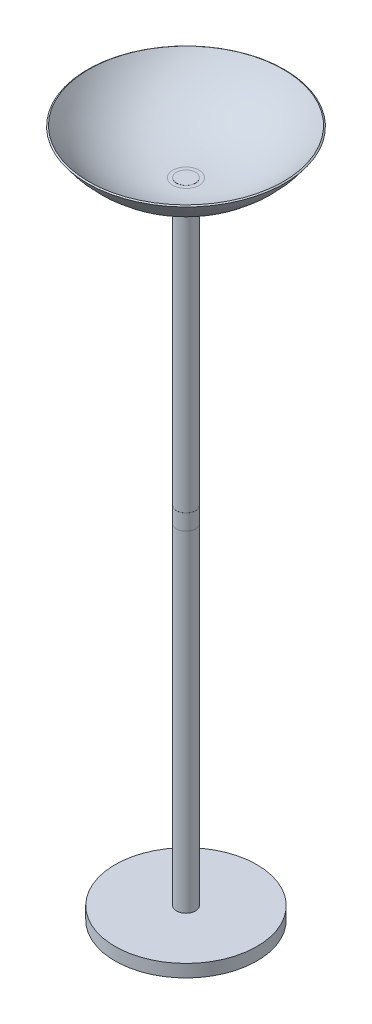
ISO-10303-21;
HEADER;
FILE_DESCRIPTION(('STEP AP214'),'2;1');
FILE_NAME('part.step','',(''),(''),'','','');
FILE_SCHEMA(('AUTOMOTIVE_DESIGN { 1 0 10303 214 1 1 1 1 }'));
ENDSEC;
DATA;
#1=APPLICATION_CONTEXT('core data for automotive mechanical design processes');
#2=APPLICATION_PROTOCOL_DEFINITION('international standard','automotive_design',2000,#1);
#3=PRODUCT_CONTEXT('',#1,'mechanical');
#4=PRODUCT('Part','Part','',(#3));
#5=PRODUCT_RELATED_PRODUCT_CATEGORY('part','',(#4));
#6=PRODUCT_DEFINITION_FORMATION('','',#4);
#7=PRODUCT_DEFINITION_CONTEXT('part definition',#1,'design');
#8=PRODUCT_DEFINITION('design','',#6,#7);
#9=PRODUCT_DEFINITION_SHAPE('','',#8);
#10=(LENGTH_UNIT() NAMED_UNIT(*) SI_UNIT(.MILLI.,.METRE.));
#11=(NAMED_UNIT(*) PLANE_ANGLE_UNIT() SI_UNIT($,.RADIAN.));
#12=(NAMED_UNIT(*) SI_UNIT($,.STERADIAN.) SOLID_ANGLE_UNIT());
#13=UNCERTAINTY_MEASURE_WITH_UNIT(LENGTH_MEASURE(1.E-05),#10,'distance_accuracy_value','');
#14=(GEOMETRIC_REPRESENTATION_CONTEXT(3) GLOBAL_UNCERTAINTY_ASSIGNED_CONTEXT((#13)) GLOBAL_UNIT_ASSIGNED_CONTEXT((#10,
#11,#12)) REPRESENTATION_CONTEXT('',''));
#15=CARTESIAN_POINT('',(0.,0.,0.));
#16=DIRECTION('',(0.,0.,1.));
#17=DIRECTION('',(1.,0.,0.));
#18=AXIS2_PLACEMENT_3D('',#15,#16,#17);
#19=CARTESIAN_POINT('',(0.,972.759098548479,0.));
#20=DIRECTION('',(0.,-1.,0.));
#21=DIRECTION('',(0.,0.,-1.));
#22=AXIS2_PLACEMENT_3D('',#19,#20,#21);
#23=CYLINDRICAL_SURFACE('',#22,24.);
#24=CARTESIAN_POINT('',(0.,252.759098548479,0.));
#25=DIRECTION('',(0.,-1.,0.));
#26=DIRECTION('',(0.,0.,-1.));
#27=AXIS2_PLACEMENT_3D('',#24,#25,#26);
#28=CIRCLE('',#27,24.);
#29=CARTESIAN_POINT('',(0.,252.759098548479,-24.));
#30=VERTEX_POINT('',#29);
#31=EDGE_CURVE('E44',#30,#30,#28,.T.);
#32=CARTESIAN_POINT('',(0.,968.592614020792,0.));
#33=DIRECTION('',(0.,1.,0.));
#34=DIRECTION('',(0.,0.,1.));
#35=AXIS2_PLACEMENT_3D('',#32,#33,#34);
#36=CIRCLE('',#35,24.);
#37=CARTESIAN_POINT('',(0.,968.592614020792,-24.));
#38=VERTEX_POINT('',#37);
#39=EDGE_CURVE('E10',#38,#38,#36,.T.);
#40=CARTESIAN_POINT('',(0.,252.759098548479,-24.));
#41=CARTESIAN_POINT('',(0.,260.215697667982,-24.));
#42=CARTESIAN_POINT('',(0.,267.672296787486,-24.));
#43=CARTESIAN_POINT('',(0.,282.585495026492,-24.));
#44=CARTESIAN_POINT('',(0.,290.042094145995,-24.));
#45=CARTESIAN_POINT('',(0.,304.955292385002,-24.));
#46=CARTESIAN_POINT('',(0.,312.411891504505,-24.));
#47=CARTESIAN_POINT('',(0.,327.325089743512,-24.));
#48=CARTESIAN_POINT('',(0.,334.781688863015,-24.));
#49=CARTESIAN_POINT('',(0.,349.694887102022,-24.));
#50=CARTESIAN_POINT('',(0.,357.151486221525,-24.));
#51=CARTESIAN_POINT('',(0.,372.064684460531,-24.));
#52=CARTESIAN_POINT('',(0.,379.521283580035,-24.));
#53=CARTESIAN_POINT('',(0.,394.434481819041,-24.));
#54=CARTESIAN_POINT('',(0.,401.891080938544,-24.));
#55=CARTESIAN_POINT('',(0.,416.804279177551,-24.));
#56=CARTESIAN_POINT('',(0.,424.260878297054,-24.));
#57=CARTESIAN_POINT('',(0.,439.174076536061,-24.));
#58=CARTESIAN_POINT('',(0.,446.630675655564,-24.));
#59=CARTESIAN_POINT('',(0.,461.543873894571,-24.));
#60=CARTESIAN_POINT('',(0.,469.000473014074,-24.));
#61=CARTESIAN_POINT('',(0.,483.91367125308,-24.));
#62=CARTESIAN_POINT('',(0.,491.370270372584,-24.));
#63=CARTESIAN_POINT('',(0.,506.28346861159,-24.));
#64=CARTESIAN_POINT('',(0.,513.740067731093,-24.));
#65=CARTESIAN_POINT('',(0.,528.6532659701,-24.));
#66=CARTESIAN_POINT('',(0.,536.109865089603,-24.));
#67=CARTESIAN_POINT('',(0.,551.02306332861,-24.));
#68=CARTESIAN_POINT('',(0.,558.479662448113,-24.));
#69=CARTESIAN_POINT('',(0.,573.392860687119,-24.));
#70=CARTESIAN_POINT('',(0.,580.849459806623,-24.));
#71=CARTESIAN_POINT('',(0.,595.762658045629,-24.));
#72=CARTESIAN_POINT('',(0.,603.219257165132,-24.));
#73=CARTESIAN_POINT('',(0.,618.132455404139,-24.));
#74=CARTESIAN_POINT('',(0.,625.589054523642,-24.));
#75=CARTESIAN_POINT('',(0.,640.502252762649,-24.));
#76=CARTESIAN_POINT('',(0.,647.958851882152,-24.));
#77=CARTESIAN_POINT('',(0.,662.872050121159,-24.));
#78=CARTESIAN_POINT('',(0.,670.328649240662,-24.));
#79=CARTESIAN_POINT('',(0.,685.241847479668,-24.));
#80=CARTESIAN_POINT('',(0.,692.698446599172,-24.));
#81=CARTESIAN_POINT('',(0.,707.611644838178,-24.));
#82=CARTESIAN_POINT('',(0.,715.068243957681,-24.));
#83=CARTESIAN_POINT('',(0.,729.981442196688,-24.));
#84=CARTESIAN_POINT('',(0.,737.438041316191,-24.));
#85=CARTESIAN_POINT('',(0.,752.351239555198,-24.));
#86=CARTESIAN_POINT('',(0.,759.807838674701,-24.));
#87=CARTESIAN_POINT('',(0.,774.721036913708,-24.));
#88=CARTESIAN_POINT('',(0.,782.177636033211,-24.));
#89=CARTESIAN_POINT('',(0.,797.090834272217,-24.));
#90=CARTESIAN_POINT('',(0.,804.547433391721,-24.));
#91=CARTESIAN_POINT('',(0.,819.460631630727,-24.));
#92=CARTESIAN_POINT('',(0.,826.91723075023,-24.));
#93=CARTESIAN_POINT('',(0.,841.830428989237,-24.));
#94=CARTESIAN_POINT('',(0.,849.28702810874,-24.));
#95=CARTESIAN_POINT('',(0.,864.200226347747,-24.));
#96=CARTESIAN_POINT('',(0.,871.65682546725,-24.));
#97=CARTESIAN_POINT('',(0.,886.570023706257,-24.));
#98=CARTESIAN_POINT('',(0.,894.02662282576,-24.));
#99=CARTESIAN_POINT('',(0.,908.939821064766,-24.));
#100=CARTESIAN_POINT('',(0.,916.39642018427,-24.));
#101=CARTESIAN_POINT('',(0.,931.309618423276,-24.));
#102=CARTESIAN_POINT('',(0.,938.766217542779,-24.));
#103=CARTESIAN_POINT('',(0.,953.679415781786,-24.));
#104=CARTESIAN_POINT('',(0.,961.136014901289,-24.));
#105=CARTESIAN_POINT('',(0.,968.592614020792,-24.));
#106=B_SPLINE_CURVE_WITH_KNOTS('',3,(#40,#41,#42,#43,#44,#45,#46,#47,#48,#49,#50,#51,#52,#53,
#54,#55,#56,#57,#58,#59,#60,#61,#62,#63,#64,#65,#66,#67,#68,#69,#70,#71,#72,#73,#74,#75,#76,#77,
#78,#79,#80,#81,#82,#83,#84,#85,#86,#87,#88,#89,#90,#91,#92,#93,#94,#95,#96,#97,#98,#99,#100,
#101,#102,#103,#104,#105),.UNSPECIFIED.,.F.,.F.,(4,2,2,2,2,2,2,2,2,2,2,2,2,2,2,2,2,2,2,2,2,2,2,
2,2,2,2,2,2,2,2,2,4),(0.,22.3697973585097,44.7395947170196,67.1093920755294,89.4791894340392,
111.848986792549,134.218784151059,156.588581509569,178.958378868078,201.328176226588,
223.697973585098,246.067770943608,268.437568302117,290.807365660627,313.177163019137,
335.546960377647,357.916757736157,380.286555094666,402.656352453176,425.026149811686,
447.395947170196,469.765744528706,492.135541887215,514.505339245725,536.875136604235,
559.244933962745,581.614731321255,603.984528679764,626.354326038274,648.724123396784,
671.093920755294,693.463718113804,715.833515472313),.UNSPECIFIED.);
#107=EDGE_CURVE('BSEAM32',#30,#38,#106,.T.);
#108=ORIENTED_EDGE('',*,*,#31,.F.);
#109=ORIENTED_EDGE('',*,*,#39,.F.);
#110=ORIENTED_EDGE('',*,*,#107,.T.);
#111=ORIENTED_EDGE('',*,*,#107,.F.);
#112=EDGE_LOOP('',(#108,#110,#109,#111));
#113=FACE_BOUND('',#112,.T.);
#114=ADVANCED_FACE('F32',(#113),#23,.T.);
#115=CARTESIAN_POINT('',(0.,212.759098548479,0.));
#116=DIRECTION('',(0.,-1.,0.));
#117=DIRECTION('',(0.,0.,-1.));
#118=AXIS2_PLACEMENT_3D('',#115,#116,#117);
#119=PLANE('',#118);
#120=CARTESIAN_POINT('',(0.,212.759098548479,0.));
#121=DIRECTION('',(0.,-1.,0.));
#122=DIRECTION('',(0.,0.,-1.));
#123=AXIS2_PLACEMENT_3D('',#120,#121,#122);
#124=CIRCLE('',#123,24.2);
#125=CARTESIAN_POINT('',(0.,212.759098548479,-24.2));
#126=VERTEX_POINT('',#125);
#127=EDGE_CURVE('E49',#126,#126,#124,.T.);
#128=ORIENTED_EDGE('',*,*,#127,.T.);
#129=EDGE_LOOP('',(#128));
#130=FACE_BOUND('',#129,.T.);
#131=CARTESIAN_POINT('',(0.,212.759098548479,0.));
#132=DIRECTION('',(0.,-1.,0.));
#133=DIRECTION('',(0.,0.,-1.));
#134=AXIS2_PLACEMENT_3D('',#131,#132,#133);
#135=CIRCLE('',#134,24.);
#136=CARTESIAN_POINT('',(0.,212.759098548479,-24.));
#137=VERTEX_POINT('',#136);
#138=EDGE_CURVE('E58',#137,#137,#135,.T.);
#139=ORIENTED_EDGE('',*,*,#138,.F.);
#140=EDGE_LOOP('',(#139));
#141=FACE_BOUND('',#140,.T.);
#142=ADVANCED_FACE('F97',(#130,#141),#119,.T.);
#143=CARTESIAN_POINT('',(0.,252.759098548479,0.));
#144=DIRECTION('',(0.,-1.,0.));
#145=DIRECTION('',(0.,0.,-1.));
#146=AXIS2_PLACEMENT_3D('',#143,#144,#145);
#147=PLANE('',#146);
#148=CARTESIAN_POINT('',(0.,252.759098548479,0.));
#149=DIRECTION('',(0.,-1.,0.));
#150=DIRECTION('',(0.,0.,-1.));
#151=AXIS2_PLACEMENT_3D('',#148,#149,#150);
#152=CIRCLE('',#151,24.2);
#153=CARTESIAN_POINT('',(0.,252.759098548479,-24.2));
#154=VERTEX_POINT('',#153);
#155=EDGE_CURVE('E52',#154,#154,#152,.T.);
#156=ORIENTED_EDGE('',*,*,#155,.F.);
#157=EDGE_LOOP('',(#156));
#158=FACE_BOUND('',#157,.T.);
#159=ORIENTED_EDGE('',*,*,#31,.T.);
#160=EDGE_LOOP('',(#159));
#161=FACE_BOUND('',#160,.T.);
#162=ADVANCED_FACE('F102',(#158,#161),#147,.F.);
#163=CARTESIAN_POINT('',(0.,212.759098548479,0.));
#164=DIRECTION('',(0.,1.,0.));
#165=DIRECTION('',(0.,0.,1.));
#166=AXIS2_PLACEMENT_3D('',#163,#164,#165);
#167=CYLINDRICAL_SURFACE('',#166,24.2);
#168=ORIENTED_EDGE('',*,*,#127,.F.);
#169=EDGE_LOOP('',(#168));
#170=FACE_BOUND('',#169,.T.);
#171=ORIENTED_EDGE('',*,*,#155,.T.);
#172=EDGE_LOOP('',(#171));
#173=FACE_BOUND('',#172,.T.);
#174=ADVANCED_FACE('F126',(#170,#173),#167,.T.);
#175=CARTESIAN_POINT('',(0.,-627.240901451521,0.));
#176=DIRECTION('',(0.,1.,0.));
#177=DIRECTION('',(0.,0.,1.));
#178=AXIS2_PLACEMENT_3D('',#175,#176,#177);
#179=CYLINDRICAL_SURFACE('',#178,24.);
#180=CARTESIAN_POINT('',(0.,-627.240901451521,0.));
#181=DIRECTION('',(0.,-1.,0.));
#182=DIRECTION('',(0.,0.,-1.));
#183=AXIS2_PLACEMENT_3D('',#180,#181,#182);
#184=CIRCLE('',#183,24.);
#185=CARTESIAN_POINT('',(0.,-627.240901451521,-24.));
#186=VERTEX_POINT('',#185);
#187=EDGE_CURVE('E55',#186,#186,#184,.T.);
#188=ORIENTED_EDGE('',*,*,#187,.F.);
#189=EDGE_LOOP('',(#188));
#190=FACE_BOUND('',#189,.T.);
#191=ORIENTED_EDGE('',*,*,#138,.T.);
#192=EDGE_LOOP('',(#191));
#193=FACE_BOUND('',#192,.T.);
#194=ADVANCED_FACE('F128',(#190,#193),#179,.T.);
#195=CARTESIAN_POINT('',(0.,-627.240901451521,0.));
#196=DIRECTION('',(0.,-1.,0.));
#197=DIRECTION('',(0.,0.,-1.));
#198=AXIS2_PLACEMENT_3D('',#195,#196,#197);
#199=PLANE('',#198);
#200=CARTESIAN_POINT('',(0.,-627.240901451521,0.));
#201=DIRECTION('',(0.,-1.,0.));
#202=DIRECTION('',(0.,0.,-1.));
#203=AXIS2_PLACEMENT_3D('',#200,#201,#202);
#204=CIRCLE('',#203,180.);
#205=CARTESIAN_POINT('',(0.,-627.240901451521,-180.));
#206=VERTEX_POINT('',#205);
#207=EDGE_CURVE('E64',#206,#206,#204,.T.);
#208=ORIENTED_EDGE('',*,*,#207,.F.);
#209=EDGE_LOOP('',(#208));
#210=FACE_BOUND('',#209,.T.);
#211=ORIENTED_EDGE('',*,*,#187,.T.);
#212=EDGE_LOOP('',(#211));
#213=FACE_BOUND('',#212,.T.);
#214=ADVANCED_FACE('F136',(#210,#213),#199,.F.);
#215=CARTESIAN_POINT('',(0.,-659.240901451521,0.));
#216=DIRECTION('',(0.,1.,0.));
#217=DIRECTION('',(0.,0.,1.));
#218=AXIS2_PLACEMENT_3D('',#215,#216,#217);
#219=CYLINDRICAL_SURFACE('',#218,180.);
#220=CARTESIAN_POINT('',(0.,-659.240901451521,0.));
#221=DIRECTION('',(0.,-1.,0.));
#222=DIRECTION('',(0.,0.,-1.));
#223=AXIS2_PLACEMENT_3D('',#220,#221,#222);
#224=CIRCLE('',#223,180.);
#225=CARTESIAN_POINT('',(0.,-659.240901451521,-180.));
#226=VERTEX_POINT('',#225);
#227=EDGE_CURVE('E61',#226,#226,#224,.T.);
#228=ORIENTED_EDGE('',*,*,#227,.F.);
#229=EDGE_LOOP('',(#228));
#230=FACE_BOUND('',#229,.T.);
#231=ORIENTED_EDGE('',*,*,#207,.T.);
#232=EDGE_LOOP('',(#231));
#233=FACE_BOUND('',#232,.T.);
#234=ADVANCED_FACE('F138',(#230,#233),#219,.T.);
#235=CARTESIAN_POINT('',(0.,-659.240901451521,0.));
#236=DIRECTION('',(0.,-1.,0.));
#237=DIRECTION('',(0.,0.,-1.));
#238=AXIS2_PLACEMENT_3D('',#235,#236,#237);
#239=PLANE('',#238);
#240=ORIENTED_EDGE('',*,*,#227,.T.);
#241=EDGE_LOOP('',(#240));
#242=FACE_BOUND('',#241,.T.);
#243=ADVANCED_FACE('F93',(#242),#239,.T.);
#244=CARTESIAN_POINT('',(0.,972.592614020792,0.));
#245=DIRECTION('',(0.,1.,0.));
#246=DIRECTION('',(0.,0.,1.));
#247=AXIS2_PLACEMENT_3D('',#244,#245,#246);
#248=PLANE('',#247);
#249=CARTESIAN_POINT('',(0.,972.592614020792,0.));
#250=DIRECTION('',(0.,1.,0.));
#251=DIRECTION('',(0.,0.,1.));
#252=AXIS2_PLACEMENT_3D('',#249,#250,#251);
#253=CIRCLE('',#252,33.3698763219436);
#254=CARTESIAN_POINT('',(0.,972.592614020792,33.3698763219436));
#255=VERTEX_POINT('',#254);
#256=EDGE_CURVE('E73',#255,#255,#253,.T.);
#257=ORIENTED_EDGE('',*,*,#256,.T.);
#258=EDGE_LOOP('',(#257));
#259=FACE_BOUND('',#258,.T.);
#260=CARTESIAN_POINT('',(0.,972.592614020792,0.));
#261=DIRECTION('',(0.,1.,0.));
#262=DIRECTION('',(0.,0.,1.));
#263=AXIS2_PLACEMENT_3D('',#260,#261,#262);
#264=CIRCLE('',#263,24.);
#265=CARTESIAN_POINT('',(0.,972.592614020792,-24.));
#266=VERTEX_POINT('',#265);
#267=EDGE_CURVE('E36',#266,#266,#264,.T.);
#268=ORIENTED_EDGE('',*,*,#267,.F.);
#269=EDGE_LOOP('',(#268));
#270=FACE_BOUND('',#269,.T.);
#271=ADVANCED_FACE('F84',(#259,#270),#248,.T.);
#272=CARTESIAN_POINT('',(0.,968.592614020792,0.));
#273=DIRECTION('',(0.,1.,0.));
#274=DIRECTION('',(0.,0.,1.));
#275=AXIS2_PLACEMENT_3D('',#272,#273,#274);
#276=PLANE('',#275);
#277=CARTESIAN_POINT('',(0.,968.592614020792,0.));
#278=DIRECTION('',(0.,1.,0.));
#279=DIRECTION('',(0.,0.,1.));
#280=AXIS2_PLACEMENT_3D('',#277,#278,#279);
#281=CIRCLE('',#280,33.3698763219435);
#282=CARTESIAN_POINT('',(0.,968.592614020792,33.3698763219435));
#283=VERTEX_POINT('',#282);
#284=EDGE_CURVE('E76',#283,#283,#281,.T.);
#285=ORIENTED_EDGE('',*,*,#284,.F.);
#286=EDGE_LOOP('',(#285));
#287=FACE_BOUND('',#286,.T.);
#288=ORIENTED_EDGE('',*,*,#39,.T.);
#289=EDGE_LOOP('',(#288));
#290=FACE_BOUND('',#289,.T.);
#291=ADVANCED_FACE('F82',(#287,#290),#276,.F.);
#292=CARTESIAN_POINT('',(0.,1228.61201321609,0.));
#293=DIRECTION('',(0.,1.,0.));
#294=DIRECTION('',(0.,0.,1.));
#295=AXIS2_PLACEMENT_3D('',#292,#293,#294);
#296=DEGENERATE_TOROIDAL_SURFACE('',#295,33.3698763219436,260.0193991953,.T.);
#297=CARTESIAN_POINT('',(0.,1085.25333342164,0.));
#298=DIRECTION('',(0.,1.,0.));
#299=DIRECTION('',(0.,0.,1.));
#300=AXIS2_PLACEMENT_3D('',#297,#298,#299);
#301=CIRCLE('',#300,250.299304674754);
#302=CARTESIAN_POINT('',(0.,1085.25333342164,250.299304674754));
#303=VERTEX_POINT('',#302);
#304=EDGE_CURVE('E67',#303,#303,#301,.T.);
#305=ORIENTED_EDGE('',*,*,#304,.F.);
#306=EDGE_LOOP('',(#305));
#307=FACE_BOUND('',#306,.T.);
#308=ORIENTED_EDGE('',*,*,#284,.T.);
#309=EDGE_LOOP('',(#308));
#310=FACE_BOUND('',#309,.T.);
#311=ADVANCED_FACE('F80',(#307,#310),#296,.T.);
#312=CARTESIAN_POINT('',(0.,1087.45868702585,0.));
#313=DIRECTION('',(0.,-1.,0.));
#314=DIRECTION('',(0.,0.,-1.));
#315=AXIS2_PLACEMENT_3D('',#312,#313,#314);
#316=CONICAL_SURFACE('',#315,246.962177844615,0.986828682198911);
#317=ORIENTED_EDGE('',*,*,#304,.T.);
#318=EDGE_LOOP('',(#317));
#319=FACE_BOUND('',#318,.T.);
#320=CARTESIAN_POINT('',(0.,1087.45868702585,0.));
#321=DIRECTION('',(0.,1.,0.));
#322=DIRECTION('',(0.,0.,1.));
#323=AXIS2_PLACEMENT_3D('',#320,#321,#322);
#324=CIRCLE('',#323,246.962177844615);
#325=CARTESIAN_POINT('',(0.,1087.45868702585,246.962177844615));
#326=VERTEX_POINT('',#325);
#327=EDGE_CURVE('E70',#326,#326,#324,.T.);
#328=ORIENTED_EDGE('',*,*,#327,.F.);
#329=EDGE_LOOP('',(#328));
#330=FACE_BOUND('',#329,.T.);
#331=ADVANCED_FACE('F90',(#319,#330),#316,.T.);
#332=CARTESIAN_POINT('',(0.,1228.61201321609,0.));
#333=DIRECTION('',(0.,1.,0.));
#334=DIRECTION('',(0.,0.,1.));
#335=AXIS2_PLACEMENT_3D('',#332,#333,#334);
#336=DEGENERATE_TOROIDAL_SURFACE('',#335,33.3698763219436,256.0193991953,.T.);
#337=ORIENTED_EDGE('',*,*,#327,.T.);
#338=EDGE_LOOP('',(#337));
#339=FACE_BOUND('',#338,.T.);
#340=ORIENTED_EDGE('',*,*,#256,.F.);
#341=EDGE_LOOP('',(#340));
#342=FACE_BOUND('',#341,.T.);
#343=ADVANCED_FACE('F113',(#339,#342),#336,.F.);
#344=CARTESIAN_POINT('',(0.,972.759098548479,0.));
#345=DIRECTION('',(0.,1.,0.));
#346=DIRECTION('',(0.,0.,1.));
#347=AXIS2_PLACEMENT_3D('',#344,#345,#346);
#348=PLANE('',#347);
#349=CARTESIAN_POINT('',(0.,972.759098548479,0.));
#350=DIRECTION('',(0.,1.,0.));
#351=DIRECTION('',(0.,0.,1.));
#352=AXIS2_PLACEMENT_3D('',#349,#350,#351);
#353=CIRCLE('',#352,24.);
#354=CARTESIAN_POINT('',(0.,972.759098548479,-24.));
#355=VERTEX_POINT('',#354);
#356=EDGE_CURVE('E40',#355,#355,#353,.T.);
#357=ORIENTED_EDGE('',*,*,#356,.T.);
#358=EDGE_LOOP('',(#357));
#359=FACE_BOUND('',#358,.T.);
#360=ADVANCED_FACE('F108',(#359),#348,.T.);
#361=CARTESIAN_POINT('',(0.,972.592614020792,-24.));
#362=CARTESIAN_POINT('',(0.,972.594348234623,-24.));
#363=CARTESIAN_POINT('',(0.,972.596082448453,-24.));
#364=CARTESIAN_POINT('',(0.,972.599550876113,-24.));
#365=CARTESIAN_POINT('',(0.,972.601285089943,-24.));
#366=CARTESIAN_POINT('',(0.,972.604753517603,-24.));
#367=CARTESIAN_POINT('',(0.,972.606487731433,-24.));
#368=CARTESIAN_POINT('',(0.,972.609956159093,-24.));
#369=CARTESIAN_POINT('',(0.,972.611690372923,-24.));
#370=CARTESIAN_POINT('',(0.,972.615158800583,-24.));
#371=CARTESIAN_POINT('',(0.,972.616893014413,-24.));
#372=CARTESIAN_POINT('',(0.,972.620361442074,-24.));
#373=CARTESIAN_POINT('',(0.,972.622095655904,-24.));
#374=CARTESIAN_POINT('',(0.,972.625564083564,-24.));
#375=CARTESIAN_POINT('',(0.,972.627298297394,-24.));
#376=CARTESIAN_POINT('',(0.,972.630766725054,-24.));
#377=CARTESIAN_POINT('',(0.,972.632500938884,-24.));
#378=CARTESIAN_POINT('',(0.,972.635969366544,-24.));
#379=CARTESIAN_POINT('',(0.,972.637703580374,-24.));
#380=CARTESIAN_POINT('',(0.,972.641172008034,-24.));
#381=CARTESIAN_POINT('',(0.,972.642906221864,-24.));
#382=CARTESIAN_POINT('',(0.,972.646374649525,-24.));
#383=CARTESIAN_POINT('',(0.,972.648108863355,-24.));
#384=CARTESIAN_POINT('',(0.,972.651577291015,-24.));
#385=CARTESIAN_POINT('',(0.,972.653311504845,-24.));
#386=CARTESIAN_POINT('',(0.,972.656779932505,-24.));
#387=CARTESIAN_POINT('',(0.,972.658514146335,-24.));
#388=CARTESIAN_POINT('',(0.,972.661982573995,-24.));
#389=CARTESIAN_POINT('',(0.,972.663716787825,-24.));
#390=CARTESIAN_POINT('',(0.,972.667185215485,-24.));
#391=CARTESIAN_POINT('',(0.,972.668919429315,-24.));
#392=CARTESIAN_POINT('',(0.,972.672387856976,-24.));
#393=CARTESIAN_POINT('',(0.,972.674122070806,-24.));
#394=CARTESIAN_POINT('',(0.,972.677590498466,-24.));
#395=CARTESIAN_POINT('',(0.,972.679324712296,-24.));
#396=CARTESIAN_POINT('',(0.,972.682793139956,-24.));
#397=CARTESIAN_POINT('',(0.,972.684527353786,-24.));
#398=CARTESIAN_POINT('',(0.,972.687995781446,-24.));
#399=CARTESIAN_POINT('',(0.,972.689729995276,-24.));
#400=CARTESIAN_POINT('',(0.,972.693198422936,-24.));
#401=CARTESIAN_POINT('',(0.,972.694932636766,-24.));
#402=CARTESIAN_POINT('',(0.,972.698401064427,-24.));
#403=CARTESIAN_POINT('',(0.,972.700135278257,-24.));
#404=CARTESIAN_POINT('',(0.,972.703603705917,-24.));
#405=CARTESIAN_POINT('',(0.,972.705337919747,-24.));
#406=CARTESIAN_POINT('',(0.,972.708806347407,-24.));
#407=CARTESIAN_POINT('',(0.,972.710540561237,-24.));
#408=CARTESIAN_POINT('',(0.,972.714008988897,-24.));
#409=CARTESIAN_POINT('',(0.,972.715743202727,-24.));
#410=CARTESIAN_POINT('',(0.,972.719211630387,-24.));
#411=CARTESIAN_POINT('',(0.,972.720945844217,-24.));
#412=CARTESIAN_POINT('',(0.,972.724414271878,-24.));
#413=CARTESIAN_POINT('',(0.,972.726148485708,-24.));
#414=CARTESIAN_POINT('',(0.,972.729616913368,-24.));
#415=CARTESIAN_POINT('',(0.,972.731351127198,-24.));
#416=CARTESIAN_POINT('',(0.,972.734819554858,-24.));
#417=CARTESIAN_POINT('',(0.,972.736553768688,-24.));
#418=CARTESIAN_POINT('',(0.,972.740022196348,-24.));
#419=CARTESIAN_POINT('',(0.,972.741756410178,-24.));
#420=CARTESIAN_POINT('',(0.,972.745224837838,-24.));
#421=CARTESIAN_POINT('',(0.,972.746959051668,-24.));
#422=CARTESIAN_POINT('',(0.,972.750427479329,-24.));
#423=CARTESIAN_POINT('',(0.,972.752161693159,-24.));
#424=CARTESIAN_POINT('',(0.,972.755630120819,-24.));
#425=CARTESIAN_POINT('',(0.,972.757364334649,-24.));
#426=CARTESIAN_POINT('',(0.,972.759098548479,-24.));
#427=B_SPLINE_CURVE_WITH_KNOTS('',3,(#361,#362,#363,#364,#365,#366,#367,#368,#369,#370,#371,
#372,#373,#374,#375,#376,#377,#378,#379,#380,#381,#382,#383,#384,#385,#386,#387,#388,#389,#390,
#391,#392,#393,#394,#395,#396,#397,#398,#399,#400,#401,#402,#403,#404,#405,#406,#407,#408,#409,
#410,#411,#412,#413,#414,#415,#416,#417,#418,#419,#420,#421,#422,#423,#424,#425,#426),
.UNSPECIFIED.,.F.,.F.,(4,2,2,2,2,2,2,2,2,2,2,2,2,2,2,2,2,2,2,2,2,2,2,2,2,2,2,2,2,2,2,2,4),(0.,
0.00520264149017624,0.0104052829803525,0.0156079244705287,0.020810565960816,0.0260132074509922,
0.0312158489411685,0.0364184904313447,0.041621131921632,0.0468237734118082,0.0520264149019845,
0.0572290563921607,0.062431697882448,0.0676343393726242,0.0728369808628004,0.0780396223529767,
0.0832422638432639,0.0884449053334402,0.0936475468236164,0.0988501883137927,0.10405282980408,
0.109255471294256,0.114458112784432,0.119660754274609,0.124863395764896,0.130066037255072,
0.135268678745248,0.140471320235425,0.145673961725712,0.150876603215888,0.156079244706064,
0.161281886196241,0.166484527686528),.UNSPECIFIED.);
#428=EDGE_CURVE('BSEAM34',#266,#355,#427,.T.);
#429=ORIENTED_EDGE('',*,*,#267,.T.);
#430=ORIENTED_EDGE('',*,*,#356,.F.);
#431=ORIENTED_EDGE('',*,*,#428,.T.);
#432=ORIENTED_EDGE('',*,*,#428,.F.);
#433=EDGE_LOOP('',(#429,#431,#430,#432));
#434=FACE_BOUND('',#433,.T.);
#435=ADVANCED_FACE('F34',(#434),#23,.T.);
#436=CLOSED_SHELL('',(#114,#142,#162,#174,#194,#214,#234,#243,#271,#291,#311,#331,#343,#360,#435));
#437=MANIFOLD_SOLID_BREP('B2',#436);
#438=ADVANCED_BREP_SHAPE_REPRESENTATION('',(#18,#437),#14);
#439=SHAPE_DEFINITION_REPRESENTATION(#9,#438);
ENDSEC;
END-ISO-10303-21;
